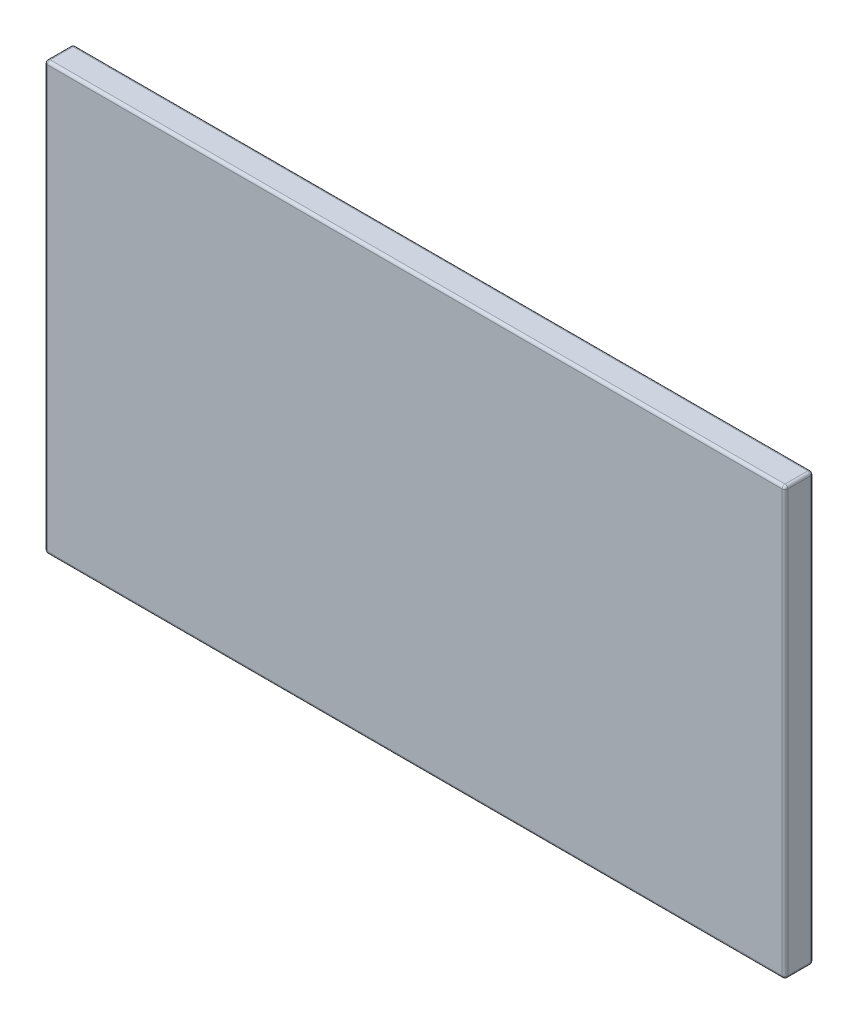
ISO-10303-21;
HEADER;
FILE_DESCRIPTION(('STEP AP214'),'2;1');
FILE_NAME('part.step','',(''),(''),'','','');
FILE_SCHEMA(('AUTOMOTIVE_DESIGN { 1 0 10303 214 1 1 1 1 }'));
ENDSEC;
DATA;
#1=APPLICATION_CONTEXT('core data for automotive mechanical design processes');
#2=APPLICATION_PROTOCOL_DEFINITION('international standard','automotive_design',2000,#1);
#3=PRODUCT_CONTEXT('',#1,'mechanical');
#4=PRODUCT('Part','Part','',(#3));
#5=PRODUCT_RELATED_PRODUCT_CATEGORY('part','',(#4));
#6=PRODUCT_DEFINITION_FORMATION('','',#4);
#7=PRODUCT_DEFINITION_CONTEXT('part definition',#1,'design');
#8=PRODUCT_DEFINITION('design','',#6,#7);
#9=PRODUCT_DEFINITION_SHAPE('','',#8);
#10=(LENGTH_UNIT() NAMED_UNIT(*) SI_UNIT(.MILLI.,.METRE.));
#11=(NAMED_UNIT(*) PLANE_ANGLE_UNIT() SI_UNIT($,.RADIAN.));
#12=(NAMED_UNIT(*) SI_UNIT($,.STERADIAN.) SOLID_ANGLE_UNIT());
#13=UNCERTAINTY_MEASURE_WITH_UNIT(LENGTH_MEASURE(1.E-05),#10,'distance_accuracy_value','');
#14=(GEOMETRIC_REPRESENTATION_CONTEXT(3) GLOBAL_UNCERTAINTY_ASSIGNED_CONTEXT((#13)) GLOBAL_UNIT_ASSIGNED_CONTEXT((#10,
#11,#12)) REPRESENTATION_CONTEXT('',''));
#15=CARTESIAN_POINT('',(0.,0.,0.));
#16=DIRECTION('',(0.,0.,1.));
#17=DIRECTION('',(1.,0.,0.));
#18=AXIS2_PLACEMENT_3D('',#15,#16,#17);
#19=CARTESIAN_POINT('',(650.,-375.,50.));
#20=DIRECTION('',(-1.,0.,0.));
#21=DIRECTION('',(0.,0.,1.));
#22=AXIS2_PLACEMENT_3D('',#19,#20,#21);
#23=PLANE('',#22);
#24=DIRECTION('',(0.,0.,-1.));
#25=VECTOR('',#24,1.);
#26=CARTESIAN_POINT('',(650.,-370.,50.));
#27=LINE('',#26,#25);
#28=CARTESIAN_POINT('',(650.,-370.,45.));
#29=VERTEX_POINT('',#28);
#30=CARTESIAN_POINT('',(650.,-370.,5.));
#31=VERTEX_POINT('',#30);
#32=EDGE_CURVE('E219',#29,#31,#27,.T.);
#33=ORIENTED_EDGE('',*,*,#32,.T.);
#34=DIRECTION('',(0.,1.,0.));
#35=VECTOR('',#34,1.);
#36=CARTESIAN_POINT('',(650.,375.,5.));
#37=LINE('',#36,#35);
#38=CARTESIAN_POINT('',(650.,370.,5.));
#39=VERTEX_POINT('',#38);
#40=EDGE_CURVE('E223',#31,#39,#37,.T.);
#41=ORIENTED_EDGE('',*,*,#40,.T.);
#42=DIRECTION('',(0.,0.,-1.));
#43=VECTOR('',#42,1.);
#44=CARTESIAN_POINT('',(650.,370.,50.));
#45=LINE('',#44,#43);
#46=CARTESIAN_POINT('',(650.,370.,45.));
#47=VERTEX_POINT('',#46);
#48=EDGE_CURVE('E224',#39,#47,#45,.F.);
#49=ORIENTED_EDGE('',*,*,#48,.T.);
#50=DIRECTION('',(0.,1.,0.));
#51=VECTOR('',#50,1.);
#52=CARTESIAN_POINT('',(650.,-375.,45.));
#53=LINE('',#52,#51);
#54=EDGE_CURVE('E228',#47,#29,#53,.F.);
#55=ORIENTED_EDGE('',*,*,#54,.T.);
#56=EDGE_LOOP('',(#33,#41,#49,#55));
#57=FACE_BOUND('',#56,.T.);
#58=ADVANCED_FACE('F36',(#57),#23,.F.);
#59=CARTESIAN_POINT('',(-650.,375.,50.));
#60=DIRECTION('',(0.,-1.,0.));
#61=DIRECTION('',(0.,0.,-1.));
#62=AXIS2_PLACEMENT_3D('',#59,#60,#61);
#63=PLANE('',#62);
#64=DIRECTION('',(0.,0.,-1.));
#65=VECTOR('',#64,1.);
#66=CARTESIAN_POINT('',(645.,375.,50.));
#67=LINE('',#66,#65);
#68=CARTESIAN_POINT('',(645.,375.,45.));
#69=VERTEX_POINT('',#68);
#70=CARTESIAN_POINT('',(645.,375.,5.));
#71=VERTEX_POINT('',#70);
#72=EDGE_CURVE('E137',#69,#71,#67,.T.);
#73=ORIENTED_EDGE('',*,*,#72,.T.);
#74=DIRECTION('',(-1.,0.,0.));
#75=VECTOR('',#74,1.);
#76=CARTESIAN_POINT('',(-650.,375.,5.));
#77=LINE('',#76,#75);
#78=CARTESIAN_POINT('',(-645.,375.,5.));
#79=VERTEX_POINT('',#78);
#80=EDGE_CURVE('E133',#71,#79,#77,.T.);
#81=ORIENTED_EDGE('',*,*,#80,.T.);
#82=DIRECTION('',(0.,0.,-1.));
#83=VECTOR('',#82,1.);
#84=CARTESIAN_POINT('',(-645.,375.,50.));
#85=LINE('',#84,#83);
#86=CARTESIAN_POINT('',(-645.,375.,45.));
#87=VERTEX_POINT('',#86);
#88=EDGE_CURVE('E128',#79,#87,#85,.F.);
#89=ORIENTED_EDGE('',*,*,#88,.T.);
#90=DIRECTION('',(-1.,0.,0.));
#91=VECTOR('',#90,1.);
#92=CARTESIAN_POINT('',(-650.,375.,45.));
#93=LINE('',#92,#91);
#94=EDGE_CURVE('E131',#87,#69,#93,.F.);
#95=ORIENTED_EDGE('',*,*,#94,.T.);
#96=EDGE_LOOP('',(#73,#81,#89,#95));
#97=FACE_BOUND('',#96,.T.);
#98=ADVANCED_FACE('F130',(#97),#63,.F.);
#99=CARTESIAN_POINT('',(-650.,-375.,50.));
#100=DIRECTION('',(1.,0.,0.));
#101=DIRECTION('',(0.,0.,-1.));
#102=AXIS2_PLACEMENT_3D('',#99,#100,#101);
#103=PLANE('',#102);
#104=DIRECTION('',(0.,-1.,0.));
#105=VECTOR('',#104,1.);
#106=CARTESIAN_POINT('',(-650.,-375.,45.));
#107=LINE('',#106,#105);
#108=CARTESIAN_POINT('',(-650.,-370.,45.));
#109=VERTEX_POINT('',#108);
#110=CARTESIAN_POINT('',(-650.,370.,45.));
#111=VERTEX_POINT('',#110);
#112=EDGE_CURVE('E271',#109,#111,#107,.F.);
#113=ORIENTED_EDGE('',*,*,#112,.T.);
#114=DIRECTION('',(0.,0.,-1.));
#115=VECTOR('',#114,1.);
#116=CARTESIAN_POINT('',(-650.,370.,50.));
#117=LINE('',#116,#115);
#118=CARTESIAN_POINT('',(-650.,370.,5.));
#119=VERTEX_POINT('',#118);
#120=EDGE_CURVE('E156',#111,#119,#117,.T.);
#121=ORIENTED_EDGE('',*,*,#120,.T.);
#122=DIRECTION('',(0.,-1.,0.));
#123=VECTOR('',#122,1.);
#124=CARTESIAN_POINT('',(-650.,-375.,5.));
#125=LINE('',#124,#123);
#126=CARTESIAN_POINT('',(-650.,-370.,5.));
#127=VERTEX_POINT('',#126);
#128=EDGE_CURVE('E279',#119,#127,#125,.T.);
#129=ORIENTED_EDGE('',*,*,#128,.T.);
#130=DIRECTION('',(0.,0.,-1.));
#131=VECTOR('',#130,1.);
#132=CARTESIAN_POINT('',(-650.,-370.,50.));
#133=LINE('',#132,#131);
#134=EDGE_CURVE('E273',#127,#109,#133,.F.);
#135=ORIENTED_EDGE('',*,*,#134,.T.);
#136=EDGE_LOOP('',(#113,#121,#129,#135));
#137=FACE_BOUND('',#136,.T.);
#138=ADVANCED_FACE('F323',(#137),#103,.F.);
#139=CARTESIAN_POINT('',(-650.,-375.,50.));
#140=DIRECTION('',(0.,1.,0.));
#141=DIRECTION('',(0.,0.,1.));
#142=AXIS2_PLACEMENT_3D('',#139,#140,#141);
#143=PLANE('',#142);
#144=DIRECTION('',(1.,0.,0.));
#145=VECTOR('',#144,1.);
#146=CARTESIAN_POINT('',(-650.,-375.,45.));
#147=LINE('',#146,#145);
#148=CARTESIAN_POINT('',(645.,-375.,45.));
#149=VERTEX_POINT('',#148);
#150=CARTESIAN_POINT('',(-645.,-375.,45.));
#151=VERTEX_POINT('',#150);
#152=EDGE_CURVE('E282',#149,#151,#147,.F.);
#153=ORIENTED_EDGE('',*,*,#152,.T.);
#154=DIRECTION('',(0.,0.,-1.));
#155=VECTOR('',#154,1.);
#156=CARTESIAN_POINT('',(-645.,-375.,50.));
#157=LINE('',#156,#155);
#158=CARTESIAN_POINT('',(-645.,-375.,5.));
#159=VERTEX_POINT('',#158);
#160=EDGE_CURVE('E287',#151,#159,#157,.T.);
#161=ORIENTED_EDGE('',*,*,#160,.T.);
#162=DIRECTION('',(1.,0.,0.));
#163=VECTOR('',#162,1.);
#164=CARTESIAN_POINT('',(650.,-375.,5.));
#165=LINE('',#164,#163);
#166=CARTESIAN_POINT('',(645.,-375.,5.));
#167=VERTEX_POINT('',#166);
#168=EDGE_CURVE('E285',#159,#167,#165,.T.);
#169=ORIENTED_EDGE('',*,*,#168,.T.);
#170=DIRECTION('',(0.,0.,-1.));
#171=VECTOR('',#170,1.);
#172=CARTESIAN_POINT('',(645.,-375.,50.));
#173=LINE('',#172,#171);
#174=EDGE_CURVE('E217',#167,#149,#173,.F.);
#175=ORIENTED_EDGE('',*,*,#174,.T.);
#176=EDGE_LOOP('',(#153,#161,#169,#175));
#177=FACE_BOUND('',#176,.T.);
#178=ADVANCED_FACE('F302',(#177),#143,.F.);
#179=CARTESIAN_POINT('',(0.,0.,50.));
#180=DIRECTION('',(0.,0.,-1.));
#181=DIRECTION('',(-1.,0.,0.));
#182=AXIS2_PLACEMENT_3D('',#179,#180,#181);
#183=PLANE('',#182);
#184=DIRECTION('',(1.,0.,0.));
#185=VECTOR('',#184,1.);
#186=CARTESIAN_POINT('',(0.,-370.,50.));
#187=LINE('',#186,#185);
#188=CARTESIAN_POINT('',(-645.,-370.,50.));
#189=VERTEX_POINT('',#188);
#190=CARTESIAN_POINT('',(645.,-370.,50.));
#191=VERTEX_POINT('',#190);
#192=EDGE_CURVE('E226',#189,#191,#187,.T.);
#193=ORIENTED_EDGE('',*,*,#192,.T.);
#194=DIRECTION('',(0.,1.,0.));
#195=VECTOR('',#194,1.);
#196=CARTESIAN_POINT('',(645.,0.,50.));
#197=LINE('',#196,#195);
#198=CARTESIAN_POINT('',(645.,370.,50.));
#199=VERTEX_POINT('',#198);
#200=EDGE_CURVE('E11',#191,#199,#197,.T.);
#201=ORIENTED_EDGE('',*,*,#200,.T.);
#202=DIRECTION('',(-1.,0.,0.));
#203=VECTOR('',#202,1.);
#204=CARTESIAN_POINT('',(0.,370.,50.));
#205=LINE('',#204,#203);
#206=CARTESIAN_POINT('',(-645.,370.,50.));
#207=VERTEX_POINT('',#206);
#208=EDGE_CURVE('E45',#199,#207,#205,.T.);
#209=ORIENTED_EDGE('',*,*,#208,.T.);
#210=DIRECTION('',(0.,-1.,0.));
#211=VECTOR('',#210,1.);
#212=CARTESIAN_POINT('',(-645.,0.,50.));
#213=LINE('',#212,#211);
#214=EDGE_CURVE('E233',#207,#189,#213,.T.);
#215=ORIENTED_EDGE('',*,*,#214,.T.);
#216=EDGE_LOOP('',(#193,#201,#209,#215));
#217=FACE_BOUND('',#216,.T.);
#218=ADVANCED_FACE('F292',(#217),#183,.F.);
#219=CARTESIAN_POINT('',(0.,0.,0.));
#220=DIRECTION('',(0.,0.,-1.));
#221=DIRECTION('',(-1.,0.,0.));
#222=AXIS2_PLACEMENT_3D('',#219,#220,#221);
#223=PLANE('',#222);
#224=DIRECTION('',(0.,-1.,0.));
#225=VECTOR('',#224,1.);
#226=CARTESIAN_POINT('',(-645.,375.,0.));
#227=LINE('',#226,#225);
#228=CARTESIAN_POINT('',(-645.,-370.,0.));
#229=VERTEX_POINT('',#228);
#230=CARTESIAN_POINT('',(-645.,370.,0.));
#231=VERTEX_POINT('',#230);
#232=EDGE_CURVE('E267',#229,#231,#227,.F.);
#233=ORIENTED_EDGE('',*,*,#232,.T.);
#234=DIRECTION('',(-1.,0.,0.));
#235=VECTOR('',#234,1.);
#236=CARTESIAN_POINT('',(650.,370.,0.));
#237=LINE('',#236,#235);
#238=CARTESIAN_POINT('',(645.,370.,0.));
#239=VERTEX_POINT('',#238);
#240=EDGE_CURVE('E264',#231,#239,#237,.F.);
#241=ORIENTED_EDGE('',*,*,#240,.T.);
#242=DIRECTION('',(0.,1.,0.));
#243=VECTOR('',#242,1.);
#244=CARTESIAN_POINT('',(645.,-375.,0.));
#245=LINE('',#244,#243);
#246=CARTESIAN_POINT('',(645.,-370.,0.));
#247=VERTEX_POINT('',#246);
#248=EDGE_CURVE('E256',#239,#247,#245,.F.);
#249=ORIENTED_EDGE('',*,*,#248,.T.);
#250=DIRECTION('',(1.,0.,0.));
#251=VECTOR('',#250,1.);
#252=CARTESIAN_POINT('',(-650.,-370.,0.));
#253=LINE('',#252,#251);
#254=EDGE_CURVE('E261',#247,#229,#253,.F.);
#255=ORIENTED_EDGE('',*,*,#254,.T.);
#256=EDGE_LOOP('',(#233,#241,#249,#255));
#257=FACE_BOUND('',#256,.T.);
#258=ADVANCED_FACE('F265',(#257),#223,.T.);
#259=CARTESIAN_POINT('',(0.,-370.,45.));
#260=DIRECTION('',(1.,0.,0.));
#261=DIRECTION('',(0.,0.,-1.));
#262=AXIS2_PLACEMENT_3D('',#259,#260,#261);
#263=CYLINDRICAL_SURFACE('',#262,5.);
#264=CARTESIAN_POINT('',(645.,-370.,45.));
#265=DIRECTION('',(1.,0.,0.));
#266=DIRECTION('',(0.,0.,-1.));
#267=AXIS2_PLACEMENT_3D('',#264,#265,#266);
#268=CIRCLE('',#267,5.);
#269=EDGE_CURVE('E40',#191,#149,#268,.T.);
#270=ORIENTED_EDGE('',*,*,#269,.F.);
#271=ORIENTED_EDGE('',*,*,#192,.F.);
#272=CARTESIAN_POINT('',(-645.,-370.,45.));
#273=DIRECTION('',(-1.,0.,0.));
#274=DIRECTION('',(0.,0.,1.));
#275=AXIS2_PLACEMENT_3D('',#272,#273,#274);
#276=CIRCLE('',#275,5.);
#277=EDGE_CURVE('E196',#151,#189,#276,.T.);
#278=ORIENTED_EDGE('',*,*,#277,.F.);
#279=ORIENTED_EDGE('',*,*,#152,.F.);
#280=EDGE_LOOP('',(#270,#271,#278,#279));
#281=FACE_BOUND('',#280,.T.);
#282=ADVANCED_FACE('F38',(#281),#263,.T.);
#283=CARTESIAN_POINT('',(645.,-370.,45.));
#284=DIRECTION('',(0.,-1.,0.));
#285=DIRECTION('',(0.,0.,-1.));
#286=AXIS2_PLACEMENT_3D('',#283,#284,#285);
#287=SPHERICAL_SURFACE('',#286,5.);
#288=CARTESIAN_POINT('',(645.,-370.,45.));
#289=DIRECTION('',(0.,-1.,0.));
#290=DIRECTION('',(0.,0.,-1.));
#291=AXIS2_PLACEMENT_3D('',#288,#289,#290);
#292=CIRCLE('',#291,5.);
#293=EDGE_CURVE('E191',#191,#29,#292,.F.);
#294=ORIENTED_EDGE('',*,*,#293,.F.);
#295=ORIENTED_EDGE('',*,*,#269,.T.);
#296=CARTESIAN_POINT('',(645.,-370.,45.));
#297=DIRECTION('',(0.,0.,1.));
#298=DIRECTION('',(1.,0.,0.));
#299=AXIS2_PLACEMENT_3D('',#296,#297,#298);
#300=CIRCLE('',#299,5.);
#301=EDGE_CURVE('E194',#29,#149,#300,.F.);
#302=ORIENTED_EDGE('',*,*,#301,.F.);
#303=EDGE_LOOP('',(#294,#295,#302));
#304=FACE_BOUND('',#303,.T.);
#305=ADVANCED_FACE('F207',(#304),#287,.T.);
#306=CARTESIAN_POINT('',(-645.,-370.,45.));
#307=DIRECTION('',(0.,0.,1.));
#308=DIRECTION('',(1.,0.,0.));
#309=AXIS2_PLACEMENT_3D('',#306,#307,#308);
#310=SPHERICAL_SURFACE('',#309,5.);
#311=CARTESIAN_POINT('',(-645.,-370.,45.));
#312=DIRECTION('',(0.,0.,1.));
#313=DIRECTION('',(1.,0.,0.));
#314=AXIS2_PLACEMENT_3D('',#311,#312,#313);
#315=CIRCLE('',#314,5.);
#316=EDGE_CURVE('E185',#151,#109,#315,.F.);
#317=ORIENTED_EDGE('',*,*,#316,.F.);
#318=ORIENTED_EDGE('',*,*,#277,.T.);
#319=CARTESIAN_POINT('',(-645.,-370.,45.));
#320=DIRECTION('',(0.,-1.,0.));
#321=DIRECTION('',(0.,0.,-1.));
#322=AXIS2_PLACEMENT_3D('',#319,#320,#321);
#323=CIRCLE('',#322,5.);
#324=EDGE_CURVE('E188',#109,#189,#323,.F.);
#325=ORIENTED_EDGE('',*,*,#324,.F.);
#326=EDGE_LOOP('',(#317,#318,#325));
#327=FACE_BOUND('',#326,.T.);
#328=ADVANCED_FACE('F294',(#327),#310,.T.);
#329=CARTESIAN_POINT('',(645.,-370.,50.));
#330=DIRECTION('',(0.,0.,-1.));
#331=DIRECTION('',(-1.,0.,0.));
#332=AXIS2_PLACEMENT_3D('',#329,#330,#331);
#333=CYLINDRICAL_SURFACE('',#332,5.);
#334=ORIENTED_EDGE('',*,*,#301,.T.);
#335=ORIENTED_EDGE('',*,*,#174,.F.);
#336=CARTESIAN_POINT('',(645.,-370.,5.));
#337=DIRECTION('',(0.,0.,-1.));
#338=DIRECTION('',(-1.,0.,0.));
#339=AXIS2_PLACEMENT_3D('',#336,#337,#338);
#340=CIRCLE('',#339,5.);
#341=EDGE_CURVE('E179',#31,#167,#340,.T.);
#342=ORIENTED_EDGE('',*,*,#341,.F.);
#343=ORIENTED_EDGE('',*,*,#32,.F.);
#344=EDGE_LOOP('',(#334,#335,#342,#343));
#345=FACE_BOUND('',#344,.T.);
#346=ADVANCED_FACE('F215',(#345),#333,.T.);
#347=CARTESIAN_POINT('',(645.,0.,45.));
#348=DIRECTION('',(0.,1.,0.));
#349=DIRECTION('',(0.,0.,1.));
#350=AXIS2_PLACEMENT_3D('',#347,#348,#349);
#351=CYLINDRICAL_SURFACE('',#350,5.);
#352=ORIENTED_EDGE('',*,*,#293,.T.);
#353=ORIENTED_EDGE('',*,*,#54,.F.);
#354=CARTESIAN_POINT('',(645.,370.,45.));
#355=DIRECTION('',(0.,1.,0.));
#356=DIRECTION('',(0.,0.,1.));
#357=AXIS2_PLACEMENT_3D('',#354,#355,#356);
#358=CIRCLE('',#357,5.);
#359=EDGE_CURVE('E177',#199,#47,#358,.T.);
#360=ORIENTED_EDGE('',*,*,#359,.F.);
#361=ORIENTED_EDGE('',*,*,#200,.F.);
#362=EDGE_LOOP('',(#352,#353,#360,#361));
#363=FACE_BOUND('',#362,.T.);
#364=ADVANCED_FACE('F291',(#363),#351,.T.);
#365=CARTESIAN_POINT('',(0.,370.,45.));
#366=DIRECTION('',(-1.,0.,0.));
#367=DIRECTION('',(0.,0.,1.));
#368=AXIS2_PLACEMENT_3D('',#365,#366,#367);
#369=CYLINDRICAL_SURFACE('',#368,5.);
#370=CARTESIAN_POINT('',(-645.,370.,45.));
#371=DIRECTION('',(-1.,0.,0.));
#372=DIRECTION('',(0.,0.,1.));
#373=AXIS2_PLACEMENT_3D('',#370,#371,#372);
#374=CIRCLE('',#373,5.);
#375=EDGE_CURVE('E143',#207,#87,#374,.T.);
#376=ORIENTED_EDGE('',*,*,#375,.F.);
#377=ORIENTED_EDGE('',*,*,#208,.F.);
#378=CARTESIAN_POINT('',(645.,370.,45.));
#379=DIRECTION('',(1.,0.,0.));
#380=DIRECTION('',(0.,0.,-1.));
#381=AXIS2_PLACEMENT_3D('',#378,#379,#380);
#382=CIRCLE('',#381,5.);
#383=EDGE_CURVE('E53',#69,#199,#382,.T.);
#384=ORIENTED_EDGE('',*,*,#383,.F.);
#385=ORIENTED_EDGE('',*,*,#94,.F.);
#386=EDGE_LOOP('',(#376,#377,#384,#385));
#387=FACE_BOUND('',#386,.T.);
#388=ADVANCED_FACE('F142',(#387),#369,.T.);
#389=CARTESIAN_POINT('',(-645.,0.,45.));
#390=DIRECTION('',(0.,-1.,0.));
#391=DIRECTION('',(0.,0.,-1.));
#392=AXIS2_PLACEMENT_3D('',#389,#390,#391);
#393=CYLINDRICAL_SURFACE('',#392,5.);
#394=ORIENTED_EDGE('',*,*,#324,.T.);
#395=ORIENTED_EDGE('',*,*,#214,.F.);
#396=CARTESIAN_POINT('',(-645.,370.,45.));
#397=DIRECTION('',(0.,1.,0.));
#398=DIRECTION('',(0.,0.,1.));
#399=AXIS2_PLACEMENT_3D('',#396,#397,#398);
#400=CIRCLE('',#399,5.);
#401=EDGE_CURVE('E152',#111,#207,#400,.T.);
#402=ORIENTED_EDGE('',*,*,#401,.F.);
#403=ORIENTED_EDGE('',*,*,#112,.F.);
#404=EDGE_LOOP('',(#394,#395,#402,#403));
#405=FACE_BOUND('',#404,.T.);
#406=ADVANCED_FACE('F428',(#405),#393,.T.);
#407=CARTESIAN_POINT('',(-645.,-370.,50.));
#408=DIRECTION('',(0.,0.,-1.));
#409=DIRECTION('',(-1.,0.,0.));
#410=AXIS2_PLACEMENT_3D('',#407,#408,#409);
#411=CYLINDRICAL_SURFACE('',#410,5.);
#412=ORIENTED_EDGE('',*,*,#316,.T.);
#413=ORIENTED_EDGE('',*,*,#134,.F.);
#414=CARTESIAN_POINT('',(-645.,-370.,5.));
#415=DIRECTION('',(0.,0.,-1.));
#416=DIRECTION('',(-1.,0.,0.));
#417=AXIS2_PLACEMENT_3D('',#414,#415,#416);
#418=CIRCLE('',#417,5.);
#419=EDGE_CURVE('E172',#159,#127,#418,.T.);
#420=ORIENTED_EDGE('',*,*,#419,.F.);
#421=ORIENTED_EDGE('',*,*,#160,.F.);
#422=EDGE_LOOP('',(#412,#413,#420,#421));
#423=FACE_BOUND('',#422,.T.);
#424=ADVANCED_FACE('F299',(#423),#411,.T.);
#425=CARTESIAN_POINT('',(-650.,-370.,5.));
#426=DIRECTION('',(-1.,0.,0.));
#427=DIRECTION('',(0.,0.,1.));
#428=AXIS2_PLACEMENT_3D('',#425,#426,#427);
#429=CYLINDRICAL_SURFACE('',#428,5.);
#430=CARTESIAN_POINT('',(645.,-370.,5.));
#431=DIRECTION('',(1.,0.,0.));
#432=DIRECTION('',(0.,0.,-1.));
#433=AXIS2_PLACEMENT_3D('',#430,#431,#432);
#434=CIRCLE('',#433,5.);
#435=EDGE_CURVE('E182',#167,#247,#434,.T.);
#436=ORIENTED_EDGE('',*,*,#435,.F.);
#437=ORIENTED_EDGE('',*,*,#168,.F.);
#438=CARTESIAN_POINT('',(-645.,-370.,5.));
#439=DIRECTION('',(-1.,0.,0.));
#440=DIRECTION('',(0.,0.,1.));
#441=AXIS2_PLACEMENT_3D('',#438,#439,#440);
#442=CIRCLE('',#441,5.);
#443=EDGE_CURVE('E170',#229,#159,#442,.T.);
#444=ORIENTED_EDGE('',*,*,#443,.F.);
#445=ORIENTED_EDGE('',*,*,#254,.F.);
#446=EDGE_LOOP('',(#436,#437,#444,#445));
#447=FACE_BOUND('',#446,.T.);
#448=ADVANCED_FACE('F305',(#447),#429,.T.);
#449=CARTESIAN_POINT('',(645.,-370.,5.));
#450=DIRECTION('',(0.,-1.,0.));
#451=DIRECTION('',(0.,0.,-1.));
#452=AXIS2_PLACEMENT_3D('',#449,#450,#451);
#453=SPHERICAL_SURFACE('',#452,5.);
#454=ORIENTED_EDGE('',*,*,#341,.T.);
#455=ORIENTED_EDGE('',*,*,#435,.T.);
#456=CARTESIAN_POINT('',(645.,-370.,5.));
#457=DIRECTION('',(0.,-1.,0.));
#458=DIRECTION('',(0.,0.,-1.));
#459=AXIS2_PLACEMENT_3D('',#456,#457,#458);
#460=CIRCLE('',#459,5.);
#461=EDGE_CURVE('E161',#31,#247,#460,.F.);
#462=ORIENTED_EDGE('',*,*,#461,.F.);
#463=EDGE_LOOP('',(#454,#455,#462));
#464=FACE_BOUND('',#463,.T.);
#465=ADVANCED_FACE('F308',(#464),#453,.T.);
#466=CARTESIAN_POINT('',(645.,370.,45.));
#467=DIRECTION('',(0.,0.,1.));
#468=DIRECTION('',(1.,0.,0.));
#469=AXIS2_PLACEMENT_3D('',#466,#467,#468);
#470=SPHERICAL_SURFACE('',#469,5.);
#471=ORIENTED_EDGE('',*,*,#383,.T.);
#472=ORIENTED_EDGE('',*,*,#359,.T.);
#473=CARTESIAN_POINT('',(645.,370.,45.));
#474=DIRECTION('',(0.,0.,1.));
#475=DIRECTION('',(1.,0.,0.));
#476=AXIS2_PLACEMENT_3D('',#473,#474,#475);
#477=CIRCLE('',#476,5.);
#478=EDGE_CURVE('E157',#69,#47,#477,.F.);
#479=ORIENTED_EDGE('',*,*,#478,.F.);
#480=EDGE_LOOP('',(#471,#472,#479));
#481=FACE_BOUND('',#480,.T.);
#482=ADVANCED_FACE('F310',(#481),#470,.T.);
#483=CARTESIAN_POINT('',(-645.,370.,45.));
#484=DIRECTION('',(0.,0.,1.));
#485=DIRECTION('',(1.,0.,0.));
#486=AXIS2_PLACEMENT_3D('',#483,#484,#485);
#487=SPHERICAL_SURFACE('',#486,5.);
#488=ORIENTED_EDGE('',*,*,#401,.T.);
#489=ORIENTED_EDGE('',*,*,#375,.T.);
#490=CARTESIAN_POINT('',(-645.,370.,45.));
#491=DIRECTION('',(0.,0.,1.));
#492=DIRECTION('',(1.,0.,0.));
#493=AXIS2_PLACEMENT_3D('',#490,#491,#492);
#494=CIRCLE('',#493,5.);
#495=EDGE_CURVE('E149',#111,#87,#494,.F.);
#496=ORIENTED_EDGE('',*,*,#495,.F.);
#497=EDGE_LOOP('',(#488,#489,#496));
#498=FACE_BOUND('',#497,.T.);
#499=ADVANCED_FACE('F148',(#498),#487,.T.);
#500=CARTESIAN_POINT('',(-645.,-370.,5.));
#501=DIRECTION('',(0.,-1.,0.));
#502=DIRECTION('',(0.,0.,-1.));
#503=AXIS2_PLACEMENT_3D('',#500,#501,#502);
#504=SPHERICAL_SURFACE('',#503,5.);
#505=ORIENTED_EDGE('',*,*,#443,.T.);
#506=ORIENTED_EDGE('',*,*,#419,.T.);
#507=CARTESIAN_POINT('',(-645.,-370.,5.));
#508=DIRECTION('',(0.,-1.,0.));
#509=DIRECTION('',(0.,0.,-1.));
#510=AXIS2_PLACEMENT_3D('',#507,#508,#509);
#511=CIRCLE('',#510,5.);
#512=EDGE_CURVE('E158',#229,#127,#511,.F.);
#513=ORIENTED_EDGE('',*,*,#512,.F.);
#514=EDGE_LOOP('',(#505,#506,#513));
#515=FACE_BOUND('',#514,.T.);
#516=ADVANCED_FACE('F348',(#515),#504,.T.);
#517=CARTESIAN_POINT('',(645.,-375.,5.));
#518=DIRECTION('',(0.,-1.,0.));
#519=DIRECTION('',(0.,0.,-1.));
#520=AXIS2_PLACEMENT_3D('',#517,#518,#519);
#521=CYLINDRICAL_SURFACE('',#520,5.);
#522=ORIENTED_EDGE('',*,*,#461,.T.);
#523=ORIENTED_EDGE('',*,*,#248,.F.);
#524=CARTESIAN_POINT('',(645.,370.,5.));
#525=DIRECTION('',(0.,1.,0.));
#526=DIRECTION('',(0.,0.,1.));
#527=AXIS2_PLACEMENT_3D('',#524,#525,#526);
#528=CIRCLE('',#527,5.);
#529=EDGE_CURVE('E164',#39,#239,#528,.T.);
#530=ORIENTED_EDGE('',*,*,#529,.F.);
#531=ORIENTED_EDGE('',*,*,#40,.F.);
#532=EDGE_LOOP('',(#522,#523,#530,#531));
#533=FACE_BOUND('',#532,.T.);
#534=ADVANCED_FACE('F258',(#533),#521,.T.);
#535=CARTESIAN_POINT('',(645.,370.,50.));
#536=DIRECTION('',(0.,0.,-1.));
#537=DIRECTION('',(-1.,0.,0.));
#538=AXIS2_PLACEMENT_3D('',#535,#536,#537);
#539=CYLINDRICAL_SURFACE('',#538,5.);
#540=ORIENTED_EDGE('',*,*,#478,.T.);
#541=ORIENTED_EDGE('',*,*,#48,.F.);
#542=CARTESIAN_POINT('',(645.,370.,5.));
#543=DIRECTION('',(0.,0.,-1.));
#544=DIRECTION('',(-1.,0.,0.));
#545=AXIS2_PLACEMENT_3D('',#542,#543,#544);
#546=CIRCLE('',#545,5.);
#547=EDGE_CURVE('E245',#71,#39,#546,.T.);
#548=ORIENTED_EDGE('',*,*,#547,.F.);
#549=ORIENTED_EDGE('',*,*,#72,.F.);
#550=EDGE_LOOP('',(#540,#541,#548,#549));
#551=FACE_BOUND('',#550,.T.);
#552=ADVANCED_FACE('F342',(#551),#539,.T.);
#553=CARTESIAN_POINT('',(-645.,370.,50.));
#554=DIRECTION('',(0.,0.,-1.));
#555=DIRECTION('',(-1.,0.,0.));
#556=AXIS2_PLACEMENT_3D('',#553,#554,#555);
#557=CYLINDRICAL_SURFACE('',#556,5.);
#558=ORIENTED_EDGE('',*,*,#495,.T.);
#559=ORIENTED_EDGE('',*,*,#88,.F.);
#560=CARTESIAN_POINT('',(-645.,370.,5.));
#561=DIRECTION('',(0.,0.,-1.));
#562=DIRECTION('',(-1.,0.,0.));
#563=AXIS2_PLACEMENT_3D('',#560,#561,#562);
#564=CIRCLE('',#563,5.);
#565=EDGE_CURVE('E242',#119,#79,#564,.T.);
#566=ORIENTED_EDGE('',*,*,#565,.F.);
#567=ORIENTED_EDGE('',*,*,#120,.F.);
#568=EDGE_LOOP('',(#558,#559,#566,#567));
#569=FACE_BOUND('',#568,.T.);
#570=ADVANCED_FACE('F154',(#569),#557,.T.);
#571=CARTESIAN_POINT('',(-645.,-375.,5.));
#572=DIRECTION('',(0.,1.,0.));
#573=DIRECTION('',(0.,0.,1.));
#574=AXIS2_PLACEMENT_3D('',#571,#572,#573);
#575=CYLINDRICAL_SURFACE('',#574,5.);
#576=ORIENTED_EDGE('',*,*,#512,.T.);
#577=ORIENTED_EDGE('',*,*,#128,.F.);
#578=CARTESIAN_POINT('',(-645.,370.,5.));
#579=DIRECTION('',(0.,1.,0.));
#580=DIRECTION('',(0.,0.,1.));
#581=AXIS2_PLACEMENT_3D('',#578,#579,#580);
#582=CIRCLE('',#581,5.);
#583=EDGE_CURVE('E240',#231,#119,#582,.T.);
#584=ORIENTED_EDGE('',*,*,#583,.F.);
#585=ORIENTED_EDGE('',*,*,#232,.F.);
#586=EDGE_LOOP('',(#576,#577,#584,#585));
#587=FACE_BOUND('',#586,.T.);
#588=ADVANCED_FACE('F336',(#587),#575,.T.);
#589=CARTESIAN_POINT('',(645.,370.,5.));
#590=DIRECTION('',(1.,0.,0.));
#591=DIRECTION('',(0.,0.,-1.));
#592=AXIS2_PLACEMENT_3D('',#589,#590,#591);
#593=SPHERICAL_SURFACE('',#592,5.);
#594=ORIENTED_EDGE('',*,*,#547,.T.);
#595=ORIENTED_EDGE('',*,*,#529,.T.);
#596=CARTESIAN_POINT('',(645.,370.,5.));
#597=DIRECTION('',(1.,0.,0.));
#598=DIRECTION('',(0.,1.,0.));
#599=AXIS2_PLACEMENT_3D('',#596,#597,#598);
#600=CIRCLE('',#599,5.);
#601=EDGE_CURVE('E238',#71,#239,#600,.F.);
#602=ORIENTED_EDGE('',*,*,#601,.F.);
#603=EDGE_LOOP('',(#594,#595,#602));
#604=FACE_BOUND('',#603,.T.);
#605=ADVANCED_FACE('F251',(#604),#593,.T.);
#606=CARTESIAN_POINT('',(-645.,370.,5.));
#607=DIRECTION('',(-1.,0.,0.));
#608=DIRECTION('',(0.,0.,1.));
#609=AXIS2_PLACEMENT_3D('',#606,#607,#608);
#610=SPHERICAL_SURFACE('',#609,5.);
#611=ORIENTED_EDGE('',*,*,#583,.T.);
#612=ORIENTED_EDGE('',*,*,#565,.T.);
#613=CARTESIAN_POINT('',(-645.,370.,5.));
#614=DIRECTION('',(-1.,0.,0.));
#615=DIRECTION('',(0.,0.,1.));
#616=AXIS2_PLACEMENT_3D('',#613,#614,#615);
#617=CIRCLE('',#616,5.);
#618=EDGE_CURVE('E236',#231,#79,#617,.F.);
#619=ORIENTED_EDGE('',*,*,#618,.F.);
#620=EDGE_LOOP('',(#611,#612,#619));
#621=FACE_BOUND('',#620,.T.);
#622=ADVANCED_FACE('F330',(#621),#610,.T.);
#623=CARTESIAN_POINT('',(-650.,370.,5.));
#624=DIRECTION('',(1.,0.,0.));
#625=DIRECTION('',(0.,0.,-1.));
#626=AXIS2_PLACEMENT_3D('',#623,#624,#625);
#627=CYLINDRICAL_SURFACE('',#626,5.);
#628=ORIENTED_EDGE('',*,*,#601,.T.);
#629=ORIENTED_EDGE('',*,*,#240,.F.);
#630=ORIENTED_EDGE('',*,*,#618,.T.);
#631=ORIENTED_EDGE('',*,*,#80,.F.);
#632=EDGE_LOOP('',(#628,#629,#630,#631));
#633=FACE_BOUND('',#632,.T.);
#634=ADVANCED_FACE('F327',(#633),#627,.T.);
#635=CLOSED_SHELL('',(#58,#98,#138,#178,#218,#258,#282,#305,#328,#346,#364,#388,#406,#424,#448,
#465,#482,#499,#516,#534,#552,#570,#588,#605,#622,#634));
#636=MANIFOLD_SOLID_BREP('B2',#635);
#637=ADVANCED_BREP_SHAPE_REPRESENTATION('',(#18,#636),#14);
#638=SHAPE_DEFINITION_REPRESENTATION(#9,#637);
ENDSEC;
END-ISO-10303-21;
